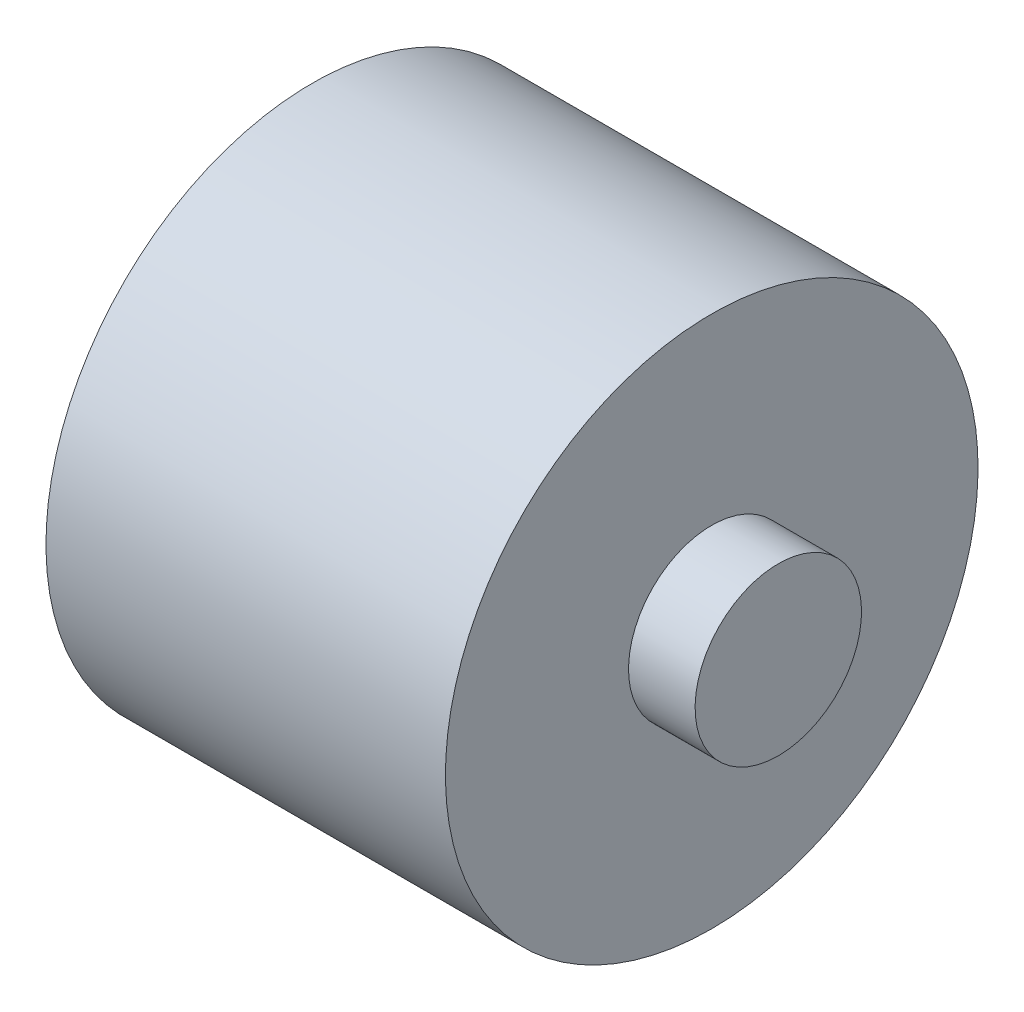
ISO-10303-21;
HEADER;
FILE_DESCRIPTION(('STEP AP214'),'2;1');
FILE_NAME('part.step','',(''),(''),'','','');
FILE_SCHEMA(('AUTOMOTIVE_DESIGN { 1 0 10303 214 1 1 1 1 }'));
ENDSEC;
DATA;
#1=APPLICATION_CONTEXT('core data for automotive mechanical design processes');
#2=APPLICATION_PROTOCOL_DEFINITION('international standard','automotive_design',2000,#1);
#3=PRODUCT_CONTEXT('',#1,'mechanical');
#4=PRODUCT('Part','Part','',(#3));
#5=PRODUCT_RELATED_PRODUCT_CATEGORY('part','',(#4));
#6=PRODUCT_DEFINITION_FORMATION('','',#4);
#7=PRODUCT_DEFINITION_CONTEXT('part definition',#1,'design');
#8=PRODUCT_DEFINITION('design','',#6,#7);
#9=PRODUCT_DEFINITION_SHAPE('','',#8);
#10=(LENGTH_UNIT() NAMED_UNIT(*) SI_UNIT(.MILLI.,.METRE.));
#11=(NAMED_UNIT(*) PLANE_ANGLE_UNIT() SI_UNIT($,.RADIAN.));
#12=(NAMED_UNIT(*) SI_UNIT($,.STERADIAN.) SOLID_ANGLE_UNIT());
#13=UNCERTAINTY_MEASURE_WITH_UNIT(LENGTH_MEASURE(1.E-05),#10,'distance_accuracy_value','');
#14=(GEOMETRIC_REPRESENTATION_CONTEXT(3) GLOBAL_UNCERTAINTY_ASSIGNED_CONTEXT((#13)) GLOBAL_UNIT_ASSIGNED_CONTEXT((#10,
#11,#12)) REPRESENTATION_CONTEXT('',''));
#15=CARTESIAN_POINT('',(0.,0.,0.));
#16=DIRECTION('',(0.,0.,1.));
#17=DIRECTION('',(1.,0.,0.));
#18=AXIS2_PLACEMENT_3D('',#15,#16,#17);
#19=CARTESIAN_POINT('',(4.,0.,0.));
#20=DIRECTION('',(-1.,0.,0.));
#21=DIRECTION('',(0.,-1.,0.));
#22=AXIS2_PLACEMENT_3D('',#19,#20,#21);
#23=PLANE('',#22);
#24=CARTESIAN_POINT('',(4.,0.,0.));
#25=DIRECTION('',(-1.,0.,0.));
#26=DIRECTION('',(0.,-1.,0.));
#27=AXIS2_PLACEMENT_3D('',#24,#25,#26);
#28=CIRCLE('',#27,1.25);
#29=CARTESIAN_POINT('',(4.,-1.25,0.));
#30=VERTEX_POINT('',#29);
#31=EDGE_CURVE('E12',#30,#30,#28,.T.);
#32=ORIENTED_EDGE('',*,*,#31,.F.);
#33=EDGE_LOOP('',(#32));
#34=FACE_BOUND('',#33,.T.);
#35=ADVANCED_FACE('F42',(#34),#23,.F.);
#36=CARTESIAN_POINT('',(-4.,0.,0.));
#37=DIRECTION('',(-1.,0.,0.));
#38=DIRECTION('',(0.,-1.,0.));
#39=AXIS2_PLACEMENT_3D('',#36,#37,#38);
#40=CYLINDRICAL_SURFACE('',#39,1.25);
#41=CARTESIAN_POINT('',(3.,0.,0.));
#42=DIRECTION('',(-1.,0.,0.));
#43=DIRECTION('',(0.,-1.,0.));
#44=AXIS2_PLACEMENT_3D('',#41,#42,#43);
#45=CIRCLE('',#44,1.25);
#46=CARTESIAN_POINT('',(3.,-1.25,0.));
#47=VERTEX_POINT('',#46);
#48=EDGE_CURVE('E48',#47,#47,#45,.T.);
#49=ORIENTED_EDGE('',*,*,#48,.F.);
#50=EDGE_LOOP('',(#49));
#51=FACE_BOUND('',#50,.T.);
#52=ORIENTED_EDGE('',*,*,#31,.T.);
#53=EDGE_LOOP('',(#52));
#54=FACE_BOUND('',#53,.T.);
#55=ADVANCED_FACE('F90',(#51,#54),#40,.T.);
#56=CARTESIAN_POINT('',(3.,1.25,0.));
#57=DIRECTION('',(-1.,0.,0.));
#58=DIRECTION('',(0.,-1.,0.));
#59=AXIS2_PLACEMENT_3D('',#56,#57,#58);
#60=PLANE('',#59);
#61=CARTESIAN_POINT('',(3.,0.,0.));
#62=DIRECTION('',(-1.,0.,0.));
#63=DIRECTION('',(0.,-1.,0.));
#64=AXIS2_PLACEMENT_3D('',#61,#62,#63);
#65=CIRCLE('',#64,4.);
#66=CARTESIAN_POINT('',(3.,-4.,0.));
#67=VERTEX_POINT('',#66);
#68=EDGE_CURVE('E52',#67,#67,#65,.T.);
#69=ORIENTED_EDGE('',*,*,#68,.F.);
#70=EDGE_LOOP('',(#69));
#71=FACE_BOUND('',#70,.T.);
#72=ORIENTED_EDGE('',*,*,#48,.T.);
#73=EDGE_LOOP('',(#72));
#74=FACE_BOUND('',#73,.T.);
#75=ADVANCED_FACE('F85',(#71,#74),#60,.F.);
#76=CARTESIAN_POINT('',(-4.,0.,0.));
#77=DIRECTION('',(-1.,0.,0.));
#78=DIRECTION('',(0.,-1.,0.));
#79=AXIS2_PLACEMENT_3D('',#76,#77,#78);
#80=CYLINDRICAL_SURFACE('',#79,4.);
#81=CARTESIAN_POINT('',(-3.,0.,0.));
#82=DIRECTION('',(-1.,0.,0.));
#83=DIRECTION('',(0.,-1.,0.));
#84=AXIS2_PLACEMENT_3D('',#81,#82,#83);
#85=CIRCLE('',#84,4.);
#86=CARTESIAN_POINT('',(-3.,-4.,0.));
#87=VERTEX_POINT('',#86);
#88=EDGE_CURVE('E56',#87,#87,#85,.T.);
#89=ORIENTED_EDGE('',*,*,#88,.F.);
#90=EDGE_LOOP('',(#89));
#91=FACE_BOUND('',#90,.T.);
#92=ORIENTED_EDGE('',*,*,#68,.T.);
#93=EDGE_LOOP('',(#92));
#94=FACE_BOUND('',#93,.T.);
#95=ADVANCED_FACE('F79',(#91,#94),#80,.T.);
#96=CARTESIAN_POINT('',(-3.,1.25,0.));
#97=DIRECTION('',(1.,0.,0.));
#98=DIRECTION('',(0.,1.,0.));
#99=AXIS2_PLACEMENT_3D('',#96,#97,#98);
#100=PLANE('',#99);
#101=CARTESIAN_POINT('',(-3.,0.,0.));
#102=DIRECTION('',(-1.,0.,0.));
#103=DIRECTION('',(0.,-1.,0.));
#104=AXIS2_PLACEMENT_3D('',#101,#102,#103);
#105=CIRCLE('',#104,1.25);
#106=CARTESIAN_POINT('',(-3.,-1.25,0.));
#107=VERTEX_POINT('',#106);
#108=EDGE_CURVE('E61',#107,#107,#105,.T.);
#109=ORIENTED_EDGE('',*,*,#108,.F.);
#110=EDGE_LOOP('',(#109));
#111=FACE_BOUND('',#110,.T.);
#112=ORIENTED_EDGE('',*,*,#88,.T.);
#113=EDGE_LOOP('',(#112));
#114=FACE_BOUND('',#113,.T.);
#115=ADVANCED_FACE('F73',(#111,#114),#100,.F.);
#116=CARTESIAN_POINT('',(-4.,0.,0.));
#117=DIRECTION('',(-1.,0.,0.));
#118=DIRECTION('',(0.,-1.,0.));
#119=AXIS2_PLACEMENT_3D('',#116,#117,#118);
#120=CYLINDRICAL_SURFACE('',#119,1.25);
#121=CARTESIAN_POINT('',(-4.,0.,0.));
#122=DIRECTION('',(-1.,0.,0.));
#123=DIRECTION('',(0.,-1.,0.));
#124=AXIS2_PLACEMENT_3D('',#121,#122,#123);
#125=CIRCLE('',#124,1.25);
#126=CARTESIAN_POINT('',(-4.,-1.25,0.));
#127=VERTEX_POINT('',#126);
#128=EDGE_CURVE('E64',#127,#127,#125,.T.);
#129=ORIENTED_EDGE('',*,*,#128,.F.);
#130=EDGE_LOOP('',(#129));
#131=FACE_BOUND('',#130,.T.);
#132=ORIENTED_EDGE('',*,*,#108,.T.);
#133=EDGE_LOOP('',(#132));
#134=FACE_BOUND('',#133,.T.);
#135=ADVANCED_FACE('F70',(#131,#134),#120,.T.);
#136=CARTESIAN_POINT('',(-4.,0.,0.));
#137=DIRECTION('',(1.,0.,0.));
#138=DIRECTION('',(0.,1.,0.));
#139=AXIS2_PLACEMENT_3D('',#136,#137,#138);
#140=PLANE('',#139);
#141=ORIENTED_EDGE('',*,*,#128,.T.);
#142=EDGE_LOOP('',(#141));
#143=FACE_BOUND('',#142,.T.);
#144=ADVANCED_FACE('F68',(#143),#140,.F.);
#145=CLOSED_SHELL('',(#35,#55,#75,#95,#115,#135,#144));
#146=MANIFOLD_SOLID_BREP('B2',#145);
#147=ADVANCED_BREP_SHAPE_REPRESENTATION('',(#18,#146),#14);
#148=SHAPE_DEFINITION_REPRESENTATION(#9,#147);
ENDSEC;
END-ISO-10303-21;
